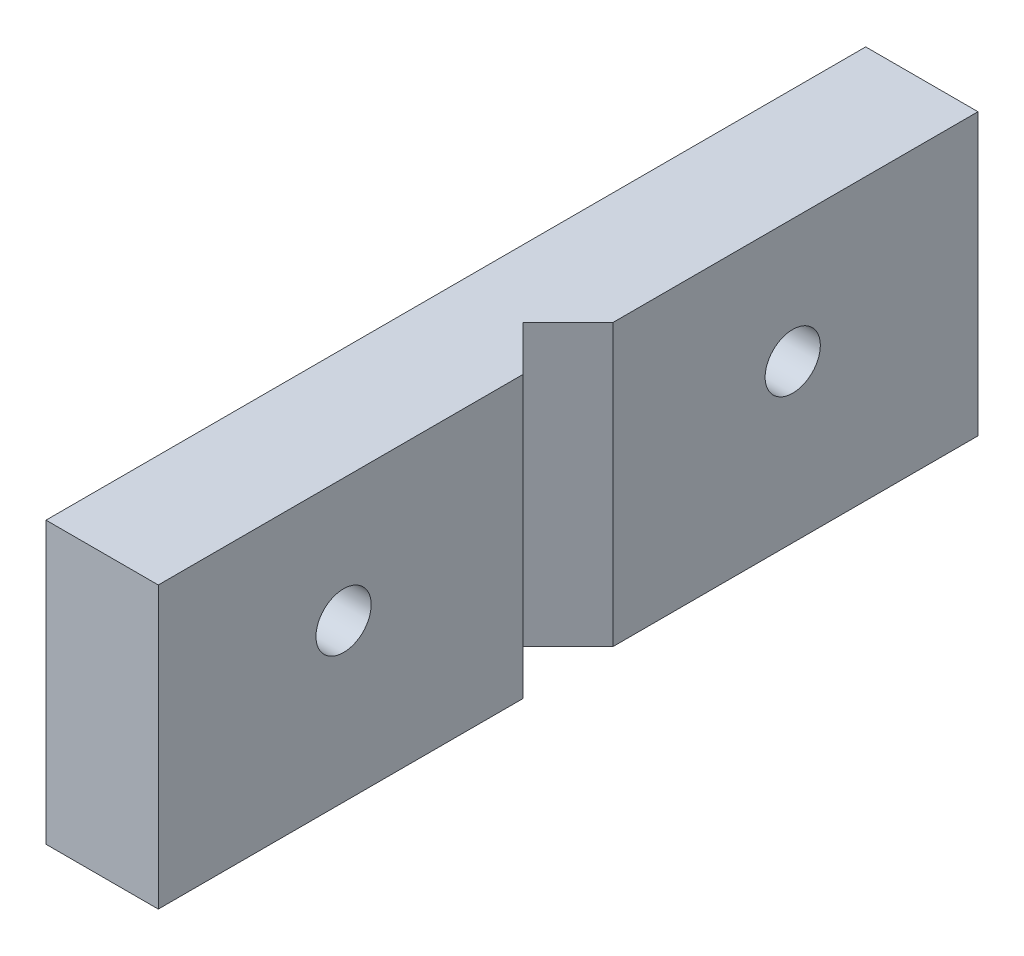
ISO-10303-21;
HEADER;
FILE_DESCRIPTION(('STEP AP214'),'2;1');
FILE_NAME('part.step','',(''),(''),'','','');
FILE_SCHEMA(('AUTOMOTIVE_DESIGN { 1 0 10303 214 1 1 1 1 }'));
ENDSEC;
DATA;
#1=APPLICATION_CONTEXT('core data for automotive mechanical design processes');
#2=APPLICATION_PROTOCOL_DEFINITION('international standard','automotive_design',2000,#1);
#3=PRODUCT_CONTEXT('',#1,'mechanical');
#4=PRODUCT('Part','Part','',(#3));
#5=PRODUCT_RELATED_PRODUCT_CATEGORY('part','',(#4));
#6=PRODUCT_DEFINITION_FORMATION('','',#4);
#7=PRODUCT_DEFINITION_CONTEXT('part definition',#1,'design');
#8=PRODUCT_DEFINITION('design','',#6,#7);
#9=PRODUCT_DEFINITION_SHAPE('','',#8);
#10=(LENGTH_UNIT() NAMED_UNIT(*) SI_UNIT(.MILLI.,.METRE.));
#11=(NAMED_UNIT(*) PLANE_ANGLE_UNIT() SI_UNIT($,.RADIAN.));
#12=(NAMED_UNIT(*) SI_UNIT($,.STERADIAN.) SOLID_ANGLE_UNIT());
#13=UNCERTAINTY_MEASURE_WITH_UNIT(LENGTH_MEASURE(1.E-05),#10,'distance_accuracy_value','');
#14=(GEOMETRIC_REPRESENTATION_CONTEXT(3) GLOBAL_UNCERTAINTY_ASSIGNED_CONTEXT((#13)) GLOBAL_UNIT_ASSIGNED_CONTEXT((#10,
#11,#12)) REPRESENTATION_CONTEXT('',''));
#15=CARTESIAN_POINT('',(0.,0.,0.));
#16=DIRECTION('',(0.,0.,1.));
#17=DIRECTION('',(1.,0.,0.));
#18=AXIS2_PLACEMENT_3D('',#15,#16,#17);
#19=CARTESIAN_POINT('',(16.5727391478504,0.,10.5727391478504));
#20=DIRECTION('',(-0.707106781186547,0.,0.707106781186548));
#21=DIRECTION('',(0.707106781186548,0.,0.707106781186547));
#22=AXIS2_PLACEMENT_3D('',#19,#20,#21);
#23=PLANE('',#22);
#24=DIRECTION('',(0.707106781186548,0.,0.707106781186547));
#25=VECTOR('',#24,1.);
#26=CARTESIAN_POINT('',(6.,0.,0.));
#27=LINE('',#26,#25);
#28=CARTESIAN_POINT('',(6.,0.,0.));
#29=VERTEX_POINT('',#28);
#30=CARTESIAN_POINT('',(10.,0.,4.));
#31=VERTEX_POINT('',#30);
#32=EDGE_CURVE('E74',#29,#31,#27,.T.);
#33=ORIENTED_EDGE('',*,*,#32,.F.);
#34=DIRECTION('',(0.,1.,0.));
#35=VECTOR('',#34,1.);
#36=CARTESIAN_POINT('',(6.,0.,0.));
#37=LINE('',#36,#35);
#38=CARTESIAN_POINT('',(6.,25.,0.));
#39=VERTEX_POINT('',#38);
#40=EDGE_CURVE('E92',#29,#39,#37,.T.);
#41=ORIENTED_EDGE('',*,*,#40,.T.);
#42=DIRECTION('',(-0.707106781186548,0.,-0.707106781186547));
#43=VECTOR('',#42,1.);
#44=CARTESIAN_POINT('',(10.,25.,3.99999999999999));
#45=LINE('',#44,#43);
#46=CARTESIAN_POINT('',(10.,25.,4.));
#47=VERTEX_POINT('',#46);
#48=EDGE_CURVE('E95',#47,#39,#45,.T.);
#49=ORIENTED_EDGE('',*,*,#48,.F.);
#50=DIRECTION('',(0.,1.,0.));
#51=VECTOR('',#50,1.);
#52=CARTESIAN_POINT('',(10.,25.,4.));
#53=LINE('',#52,#51);
#54=EDGE_CURVE('E99',#31,#47,#53,.T.);
#55=ORIENTED_EDGE('',*,*,#54,.F.);
#56=EDGE_LOOP('',(#33,#41,#49,#55));
#57=FACE_BOUND('',#56,.T.);
#58=ADVANCED_FACE('F17',(#57),#23,.F.);
#59=CARTESIAN_POINT('',(10.,25.,0.));
#60=DIRECTION('',(1.,0.,0.));
#61=DIRECTION('',(0.,0.,-1.));
#62=AXIS2_PLACEMENT_3D('',#59,#60,#61);
#63=PLANE('',#62);
#64=CARTESIAN_POINT('',(9.99999999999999,14.,20.));
#65=DIRECTION('',(-1.,0.,0.));
#66=DIRECTION('',(0.,-1.,0.));
#67=AXIS2_PLACEMENT_3D('',#64,#65,#66);
#68=CIRCLE('',#67,2.4585);
#69=CARTESIAN_POINT('',(9.99999999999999,11.5415,20.));
#70=VERTEX_POINT('',#69);
#71=EDGE_CURVE('E21',#70,#70,#68,.T.);
#72=ORIENTED_EDGE('',*,*,#71,.T.);
#73=EDGE_LOOP('',(#72));
#74=FACE_BOUND('',#73,.T.);
#75=DIRECTION('',(0.,1.,0.));
#76=VECTOR('',#75,1.);
#77=CARTESIAN_POINT('',(10.,12.5,36.5));
#78=LINE('',#77,#76);
#79=CARTESIAN_POINT('',(10.,0.,36.5));
#80=VERTEX_POINT('',#79);
#81=CARTESIAN_POINT('',(10.,25.,36.5));
#82=VERTEX_POINT('',#81);
#83=EDGE_CURVE('E85',#80,#82,#78,.T.);
#84=ORIENTED_EDGE('',*,*,#83,.F.);
#85=DIRECTION('',(0.,0.,-1.));
#86=VECTOR('',#85,1.);
#87=CARTESIAN_POINT('',(10.,0.,0.));
#88=LINE('',#87,#86);
#89=EDGE_CURVE('E126',#31,#80,#88,.F.);
#90=ORIENTED_EDGE('',*,*,#89,.F.);
#91=ORIENTED_EDGE('',*,*,#54,.T.);
#92=DIRECTION('',(0.,0.,1.));
#93=VECTOR('',#92,1.);
#94=CARTESIAN_POINT('',(10.,25.,0.));
#95=LINE('',#94,#93);
#96=EDGE_CURVE('E107',#82,#47,#95,.F.);
#97=ORIENTED_EDGE('',*,*,#96,.F.);
#98=EDGE_LOOP('',(#84,#90,#91,#97));
#99=FACE_BOUND('',#98,.T.);
#100=ADVANCED_FACE('F189',(#74,#99),#63,.T.);
#101=CARTESIAN_POINT('',(10.,25.,0.));
#102=DIRECTION('',(1.,0.,0.));
#103=DIRECTION('',(0.,0.,-1.));
#104=AXIS2_PLACEMENT_3D('',#101,#102,#103);
#105=PLANE('',#104);
#106=CARTESIAN_POINT('',(9.99999999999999,14.,-20.));
#107=DIRECTION('',(-1.,0.,0.));
#108=DIRECTION('',(0.,-1.,0.));
#109=AXIS2_PLACEMENT_3D('',#106,#107,#108);
#110=CIRCLE('',#109,2.4585);
#111=CARTESIAN_POINT('',(9.99999999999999,11.5415,-20.));
#112=VERTEX_POINT('',#111);
#113=EDGE_CURVE('E109',#112,#112,#110,.T.);
#114=ORIENTED_EDGE('',*,*,#113,.T.);
#115=EDGE_LOOP('',(#114));
#116=FACE_BOUND('',#115,.T.);
#117=DIRECTION('',(0.,1.,0.));
#118=VECTOR('',#117,1.);
#119=CARTESIAN_POINT('',(10.,12.5,-36.5));
#120=LINE('',#119,#118);
#121=CARTESIAN_POINT('',(10.,0.,-36.5));
#122=VERTEX_POINT('',#121);
#123=CARTESIAN_POINT('',(10.,25.,-36.5));
#124=VERTEX_POINT('',#123);
#125=EDGE_CURVE('E113',#122,#124,#120,.T.);
#126=ORIENTED_EDGE('',*,*,#125,.T.);
#127=DIRECTION('',(0.,0.,1.));
#128=VECTOR('',#127,1.);
#129=CARTESIAN_POINT('',(10.,25.,0.));
#130=LINE('',#129,#128);
#131=CARTESIAN_POINT('',(10.,25.,-4.));
#132=VERTEX_POINT('',#131);
#133=EDGE_CURVE('E80',#132,#124,#130,.F.);
#134=ORIENTED_EDGE('',*,*,#133,.F.);
#135=DIRECTION('',(0.,1.,0.));
#136=VECTOR('',#135,1.);
#137=CARTESIAN_POINT('',(10.,0.,-4.));
#138=LINE('',#137,#136);
#139=CARTESIAN_POINT('',(10.,0.,-4.));
#140=VERTEX_POINT('',#139);
#141=EDGE_CURVE('E59',#132,#140,#138,.F.);
#142=ORIENTED_EDGE('',*,*,#141,.T.);
#143=DIRECTION('',(0.,0.,-1.));
#144=VECTOR('',#143,1.);
#145=CARTESIAN_POINT('',(10.,0.,0.));
#146=LINE('',#145,#144);
#147=EDGE_CURVE('E120',#122,#140,#146,.F.);
#148=ORIENTED_EDGE('',*,*,#147,.F.);
#149=EDGE_LOOP('',(#126,#134,#142,#148));
#150=FACE_BOUND('',#149,.T.);
#151=ADVANCED_FACE('F184',(#116,#150),#105,.T.);
#152=CARTESIAN_POINT('',(6.,0.,0.));
#153=DIRECTION('',(-0.707106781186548,0.,-0.707106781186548));
#154=DIRECTION('',(-0.707106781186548,0.,0.707106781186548));
#155=AXIS2_PLACEMENT_3D('',#152,#153,#154);
#156=PLANE('',#155);
#157=DIRECTION('',(0.707106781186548,0.,-0.707106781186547));
#158=VECTOR('',#157,1.);
#159=CARTESIAN_POINT('',(6.,25.,0.));
#160=LINE('',#159,#158);
#161=EDGE_CURVE('E101',#39,#132,#160,.T.);
#162=ORIENTED_EDGE('',*,*,#161,.F.);
#163=ORIENTED_EDGE('',*,*,#40,.F.);
#164=DIRECTION('',(-0.707106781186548,0.,0.707106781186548));
#165=VECTOR('',#164,1.);
#166=CARTESIAN_POINT('',(10.,0.,-4.));
#167=LINE('',#166,#165);
#168=EDGE_CURVE('E117',#140,#29,#167,.T.);
#169=ORIENTED_EDGE('',*,*,#168,.F.);
#170=ORIENTED_EDGE('',*,*,#141,.F.);
#171=EDGE_LOOP('',(#162,#163,#169,#170));
#172=FACE_BOUND('',#171,.T.);
#173=ADVANCED_FACE('F102',(#172),#156,.F.);
#174=CARTESIAN_POINT('',(77.8074546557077,14.,20.));
#175=DIRECTION('',(-1.,0.,0.));
#176=DIRECTION('',(0.,-1.,0.));
#177=AXIS2_PLACEMENT_3D('',#174,#175,#176);
#178=CYLINDRICAL_SURFACE('',#177,2.4585);
#179=CARTESIAN_POINT('',(0.,14.,20.));
#180=DIRECTION('',(-1.,0.,0.));
#181=DIRECTION('',(0.,-1.,0.));
#182=AXIS2_PLACEMENT_3D('',#179,#180,#181);
#183=CIRCLE('',#182,2.4585);
#184=CARTESIAN_POINT('',(0.,11.5415,20.));
#185=VERTEX_POINT('',#184);
#186=EDGE_CURVE('E119',#185,#185,#183,.F.);
#187=ORIENTED_EDGE('',*,*,#186,.F.);
#188=EDGE_LOOP('',(#187));
#189=FACE_BOUND('',#188,.T.);
#190=ORIENTED_EDGE('',*,*,#71,.F.);
#191=EDGE_LOOP('',(#190));
#192=FACE_BOUND('',#191,.T.);
#193=ADVANCED_FACE('F163',(#189,#192),#178,.F.);
#194=CARTESIAN_POINT('',(77.8074546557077,14.,-20.));
#195=DIRECTION('',(-1.,0.,0.));
#196=DIRECTION('',(0.,-1.,0.));
#197=AXIS2_PLACEMENT_3D('',#194,#195,#196);
#198=CYLINDRICAL_SURFACE('',#197,2.4585);
#199=CARTESIAN_POINT('',(0.,14.,-20.));
#200=DIRECTION('',(-1.,0.,0.));
#201=DIRECTION('',(0.,-1.,0.));
#202=AXIS2_PLACEMENT_3D('',#199,#200,#201);
#203=CIRCLE('',#202,2.4585);
#204=CARTESIAN_POINT('',(0.,11.5415,-20.));
#205=VERTEX_POINT('',#204);
#206=EDGE_CURVE('E136',#205,#205,#203,.F.);
#207=ORIENTED_EDGE('',*,*,#206,.F.);
#208=EDGE_LOOP('',(#207));
#209=FACE_BOUND('',#208,.T.);
#210=ORIENTED_EDGE('',*,*,#113,.F.);
#211=EDGE_LOOP('',(#210));
#212=FACE_BOUND('',#211,.T.);
#213=ADVANCED_FACE('F154',(#209,#212),#198,.F.);
#214=CARTESIAN_POINT('',(5.,12.5,36.5));
#215=DIRECTION('',(0.,0.,1.));
#216=DIRECTION('',(1.,0.,0.));
#217=AXIS2_PLACEMENT_3D('',#214,#215,#216);
#218=PLANE('',#217);
#219=ORIENTED_EDGE('',*,*,#83,.T.);
#220=DIRECTION('',(1.,0.,0.));
#221=VECTOR('',#220,1.);
#222=CARTESIAN_POINT('',(0.,25.,36.5));
#223=LINE('',#222,#221);
#224=CARTESIAN_POINT('',(0.,25.,36.5));
#225=VERTEX_POINT('',#224);
#226=EDGE_CURVE('E150',#225,#82,#223,.T.);
#227=ORIENTED_EDGE('',*,*,#226,.F.);
#228=DIRECTION('',(0.,-1.,0.));
#229=VECTOR('',#228,1.);
#230=CARTESIAN_POINT('',(0.,0.,36.5));
#231=LINE('',#230,#229);
#232=CARTESIAN_POINT('',(0.,0.,36.5));
#233=VERTEX_POINT('',#232);
#234=EDGE_CURVE('E50',#233,#225,#231,.F.);
#235=ORIENTED_EDGE('',*,*,#234,.F.);
#236=DIRECTION('',(1.,0.,0.));
#237=VECTOR('',#236,1.);
#238=CARTESIAN_POINT('',(10.,0.,36.5));
#239=LINE('',#238,#237);
#240=EDGE_CURVE('E124',#80,#233,#239,.F.);
#241=ORIENTED_EDGE('',*,*,#240,.F.);
#242=EDGE_LOOP('',(#219,#227,#235,#241));
#243=FACE_BOUND('',#242,.T.);
#244=ADVANCED_FACE('F152',(#243),#218,.T.);
#245=CARTESIAN_POINT('',(0.,25.,0.));
#246=DIRECTION('',(0.,1.,0.));
#247=DIRECTION('',(0.,0.,1.));
#248=AXIS2_PLACEMENT_3D('',#245,#246,#247);
#249=PLANE('',#248);
#250=ORIENTED_EDGE('',*,*,#226,.T.);
#251=ORIENTED_EDGE('',*,*,#96,.T.);
#252=ORIENTED_EDGE('',*,*,#48,.T.);
#253=ORIENTED_EDGE('',*,*,#161,.T.);
#254=ORIENTED_EDGE('',*,*,#133,.T.);
#255=DIRECTION('',(1.,0.,0.));
#256=VECTOR('',#255,1.);
#257=CARTESIAN_POINT('',(5.,25.,-36.5));
#258=LINE('',#257,#256);
#259=CARTESIAN_POINT('',(0.,25.,-36.5));
#260=VERTEX_POINT('',#259);
#261=EDGE_CURVE('E115',#124,#260,#258,.F.);
#262=ORIENTED_EDGE('',*,*,#261,.T.);
#263=DIRECTION('',(0.,0.,1.));
#264=VECTOR('',#263,1.);
#265=CARTESIAN_POINT('',(0.,25.,0.));
#266=LINE('',#265,#264);
#267=EDGE_CURVE('E132',#225,#260,#266,.F.);
#268=ORIENTED_EDGE('',*,*,#267,.F.);
#269=EDGE_LOOP('',(#250,#251,#252,#253,#254,#262,#268));
#270=FACE_BOUND('',#269,.T.);
#271=ADVANCED_FACE('F106',(#270),#249,.T.);
#272=CARTESIAN_POINT('',(5.,12.5,-36.5));
#273=DIRECTION('',(0.,0.,1.));
#274=DIRECTION('',(1.,0.,0.));
#275=AXIS2_PLACEMENT_3D('',#272,#273,#274);
#276=PLANE('',#275);
#277=DIRECTION('',(1.,0.,0.));
#278=VECTOR('',#277,1.);
#279=CARTESIAN_POINT('',(10.,0.,-36.5));
#280=LINE('',#279,#278);
#281=CARTESIAN_POINT('',(0.,0.,-36.5));
#282=VERTEX_POINT('',#281);
#283=EDGE_CURVE('E36',#282,#122,#280,.T.);
#284=ORIENTED_EDGE('',*,*,#283,.F.);
#285=DIRECTION('',(0.,-1.,0.));
#286=VECTOR('',#285,1.);
#287=CARTESIAN_POINT('',(0.,0.,-36.5));
#288=LINE('',#287,#286);
#289=EDGE_CURVE('E27',#260,#282,#288,.T.);
#290=ORIENTED_EDGE('',*,*,#289,.F.);
#291=ORIENTED_EDGE('',*,*,#261,.F.);
#292=ORIENTED_EDGE('',*,*,#125,.F.);
#293=EDGE_LOOP('',(#284,#290,#291,#292));
#294=FACE_BOUND('',#293,.T.);
#295=ADVANCED_FACE('F161',(#294),#276,.F.);
#296=CARTESIAN_POINT('',(10.,0.,0.));
#297=DIRECTION('',(0.,-1.,0.));
#298=DIRECTION('',(0.,0.,-1.));
#299=AXIS2_PLACEMENT_3D('',#296,#297,#298);
#300=PLANE('',#299);
#301=ORIENTED_EDGE('',*,*,#147,.T.);
#302=ORIENTED_EDGE('',*,*,#168,.T.);
#303=ORIENTED_EDGE('',*,*,#32,.T.);
#304=ORIENTED_EDGE('',*,*,#89,.T.);
#305=ORIENTED_EDGE('',*,*,#240,.T.);
#306=DIRECTION('',(0.,0.,1.));
#307=VECTOR('',#306,1.);
#308=CARTESIAN_POINT('',(0.,0.,0.));
#309=LINE('',#308,#307);
#310=EDGE_CURVE('E11',#282,#233,#309,.T.);
#311=ORIENTED_EDGE('',*,*,#310,.F.);
#312=ORIENTED_EDGE('',*,*,#283,.T.);
#313=EDGE_LOOP('',(#301,#302,#303,#304,#305,#311,#312));
#314=FACE_BOUND('',#313,.T.);
#315=ADVANCED_FACE('F167',(#314),#300,.T.);
#316=CARTESIAN_POINT('',(0.,0.,0.));
#317=DIRECTION('',(-1.,0.,0.));
#318=DIRECTION('',(0.,-1.,0.));
#319=AXIS2_PLACEMENT_3D('',#316,#317,#318);
#320=PLANE('',#319);
#321=ORIENTED_EDGE('',*,*,#289,.T.);
#322=ORIENTED_EDGE('',*,*,#310,.T.);
#323=ORIENTED_EDGE('',*,*,#234,.T.);
#324=ORIENTED_EDGE('',*,*,#267,.T.);
#325=EDGE_LOOP('',(#321,#322,#323,#324));
#326=FACE_BOUND('',#325,.T.);
#327=ORIENTED_EDGE('',*,*,#206,.T.);
#328=EDGE_LOOP('',(#327));
#329=FACE_BOUND('',#328,.T.);
#330=ORIENTED_EDGE('',*,*,#186,.T.);
#331=EDGE_LOOP('',(#330));
#332=FACE_BOUND('',#331,.T.);
#333=ADVANCED_FACE('F19',(#326,#329,#332),#320,.T.);
#334=CLOSED_SHELL('',(#58,#100,#151,#173,#193,#213,#244,#271,#295,#315,#333));
#335=MANIFOLD_SOLID_BREP('B1',#334);
#336=ADVANCED_BREP_SHAPE_REPRESENTATION('',(#18,#335),#14);
#337=SHAPE_DEFINITION_REPRESENTATION(#9,#336);
ENDSEC;
END-ISO-10303-21;
